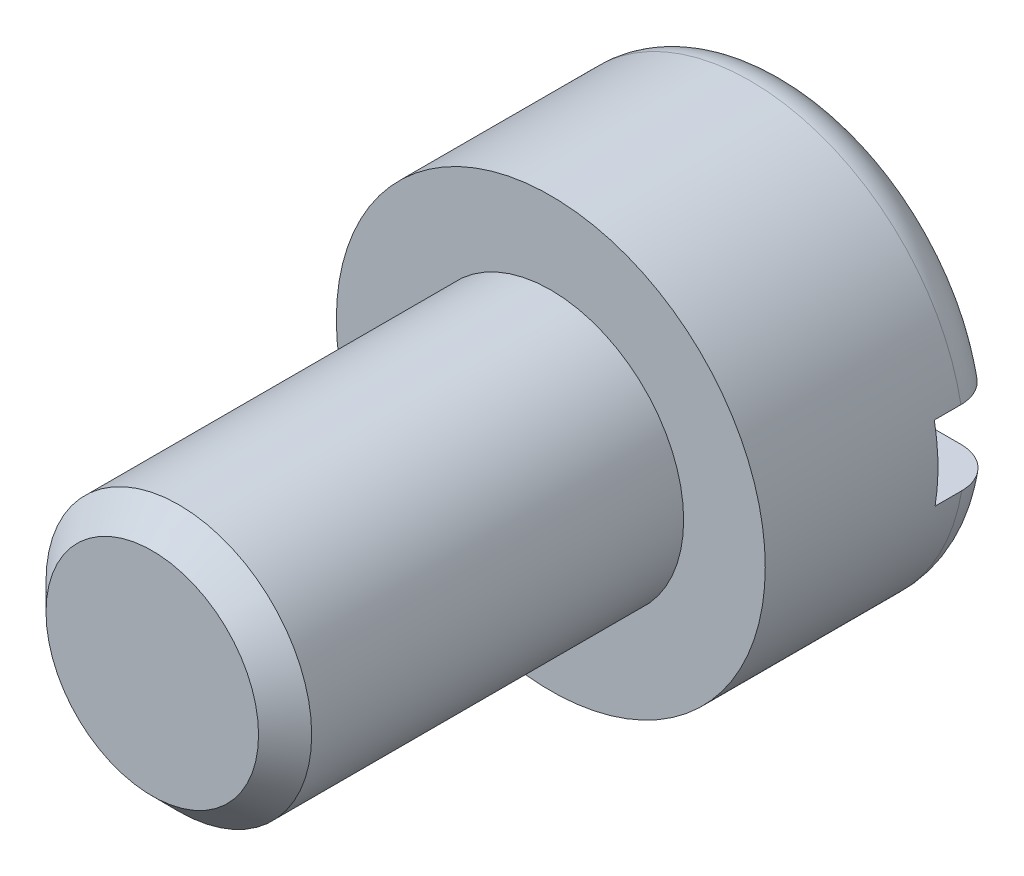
ISO-10303-21;
HEADER;
FILE_DESCRIPTION(('STEP AP214'),'2;1');
FILE_NAME('part.step','',(''),(''),'','','');
FILE_SCHEMA(('AUTOMOTIVE_DESIGN { 1 0 10303 214 1 1 1 1 }'));
ENDSEC;
DATA;
#1=APPLICATION_CONTEXT('core data for automotive mechanical design processes');
#2=APPLICATION_PROTOCOL_DEFINITION('international standard','automotive_design',2000,#1);
#3=PRODUCT_CONTEXT('',#1,'mechanical');
#4=PRODUCT('Part','Part','',(#3));
#5=PRODUCT_RELATED_PRODUCT_CATEGORY('part','',(#4));
#6=PRODUCT_DEFINITION_FORMATION('','',#4);
#7=PRODUCT_DEFINITION_CONTEXT('part definition',#1,'design');
#8=PRODUCT_DEFINITION('design','',#6,#7);
#9=PRODUCT_DEFINITION_SHAPE('','',#8);
#10=(LENGTH_UNIT() NAMED_UNIT(*) SI_UNIT(.MILLI.,.METRE.));
#11=(NAMED_UNIT(*) PLANE_ANGLE_UNIT() SI_UNIT($,.RADIAN.));
#12=(NAMED_UNIT(*) SI_UNIT($,.STERADIAN.) SOLID_ANGLE_UNIT());
#13=UNCERTAINTY_MEASURE_WITH_UNIT(LENGTH_MEASURE(1.E-05),#10,'distance_accuracy_value','');
#14=(GEOMETRIC_REPRESENTATION_CONTEXT(3) GLOBAL_UNCERTAINTY_ASSIGNED_CONTEXT((#13)) GLOBAL_UNIT_ASSIGNED_CONTEXT((#10,
#11,#12)) REPRESENTATION_CONTEXT('',''));
#15=CARTESIAN_POINT('',(0.,0.,0.));
#16=DIRECTION('',(0.,0.,1.));
#17=DIRECTION('',(1.,0.,0.));
#18=AXIS2_PLACEMENT_3D('',#15,#16,#17);
#19=CARTESIAN_POINT('',(0.,0.,-1.8));
#20=DIRECTION('',(0.,0.,-1.));
#21=DIRECTION('',(-1.,0.,0.));
#22=AXIS2_PLACEMENT_3D('',#19,#20,#21);
#23=PLANE('',#22);
#24=DIRECTION('',(1.,0.,0.));
#25=VECTOR('',#24,1.);
#26=CARTESIAN_POINT('',(2.10059804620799,0.295447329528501,-1.8));
#27=LINE('',#26,#25);
#28=CARTESIAN_POINT('',(-1.28077355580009,0.295447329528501,-1.8));
#29=VERTEX_POINT('',#28);
#30=CARTESIAN_POINT('',(1.28077355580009,0.295447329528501,-1.8));
#31=VERTEX_POINT('',#30);
#32=EDGE_CURVE('E93',#29,#31,#27,.T.);
#33=ORIENTED_EDGE('',*,*,#32,.F.);
#34=CARTESIAN_POINT('',(0.,0.,-1.8));
#35=DIRECTION('',(0.,0.,-1.));
#36=DIRECTION('',(-1.,0.,0.));
#37=AXIS2_PLACEMENT_3D('',#34,#35,#36);
#38=CIRCLE('',#37,1.31440862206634);
#39=EDGE_CURVE('E96',#29,#31,#38,.T.);
#40=ORIENTED_EDGE('',*,*,#39,.T.);
#41=EDGE_LOOP('',(#33,#40));
#42=FACE_BOUND('',#41,.T.);
#43=ADVANCED_FACE('F26',(#42),#23,.T.);
#44=CARTESIAN_POINT('',(0.,0.,-1.5));
#45=DIRECTION('',(0.,0.,-1.));
#46=DIRECTION('',(-1.,0.,0.));
#47=AXIS2_PLACEMENT_3D('',#44,#45,#46);
#48=TOROIDAL_SURFACE('',#47,1.31440862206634,0.3);
#49=CARTESIAN_POINT('',(-1.53651760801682,0.295447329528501,-1.66544460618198));
#50=CARTESIAN_POINT('',(-1.52700600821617,0.295447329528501,-1.6795717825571));
#51=CARTESIAN_POINT('',(-1.51627677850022,0.295447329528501,-1.69289589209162));
#52=CARTESIAN_POINT('',(-1.49271348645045,0.295447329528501,-1.71755329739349));
#53=CARTESIAN_POINT('',(-1.47987648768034,0.295447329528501,-1.72888376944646));
#54=CARTESIAN_POINT('',(-1.45250623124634,0.295447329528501,-1.74922518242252));
#55=CARTESIAN_POINT('',(-1.43797521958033,0.295447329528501,-1.75823914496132));
#56=CARTESIAN_POINT('',(-1.40762887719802,0.295447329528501,-1.77373787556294));
#57=CARTESIAN_POINT('',(-1.39181386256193,0.295447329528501,-1.78022326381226));
#58=CARTESIAN_POINT('',(-1.35909219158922,0.295447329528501,-1.79059717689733));
#59=CARTESIAN_POINT('',(-1.3421726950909,0.295447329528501,-1.79444518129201));
#60=CARTESIAN_POINT('',(-1.30793062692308,0.295447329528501,-1.79930680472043));
#61=CARTESIAN_POINT('',(-1.2906079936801,0.295447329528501,-1.80031998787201));
#62=CARTESIAN_POINT('',(-1.25568631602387,0.295447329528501,-1.7994960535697));
#63=CARTESIAN_POINT('',(-1.23808860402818,0.295447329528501,-1.79760200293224));
#64=CARTESIAN_POINT('',(-1.20345024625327,0.295447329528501,-1.79092116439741));
#65=CARTESIAN_POINT('',(-1.18640965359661,0.295447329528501,-1.786134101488));
#66=CARTESIAN_POINT('',(-1.15317476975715,0.295447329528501,-1.77372718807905));
#67=CARTESIAN_POINT('',(-1.13699201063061,0.295447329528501,-1.76607639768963));
#68=CARTESIAN_POINT('',(-1.1061519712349,0.295447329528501,-1.74814694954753));
#69=CARTESIAN_POINT('',(-1.09149470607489,0.295447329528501,-1.73786826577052));
#70=CARTESIAN_POINT('',(-1.06426403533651,0.295447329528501,-1.71503807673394));
#71=CARTESIAN_POINT('',(-1.05167529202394,0.295447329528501,-1.70250489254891));
#72=CARTESIAN_POINT('',(-1.02886060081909,0.295447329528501,-1.67544437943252));
#73=CARTESIAN_POINT('',(-1.01863424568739,0.295447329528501,-1.66091739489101));
#74=CARTESIAN_POINT('',(-1.00118743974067,0.295447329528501,-1.63075152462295));
#75=CARTESIAN_POINT('',(-0.993884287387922,0.295447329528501,-1.61516051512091));
#76=CARTESIAN_POINT('',(-0.982122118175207,0.295447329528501,-1.58294051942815));
#77=CARTESIAN_POINT('',(-0.97766229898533,0.295447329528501,-1.56631182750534));
#78=CARTESIAN_POINT('',(-0.971881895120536,0.295447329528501,-1.5331917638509));
#79=CARTESIAN_POINT('',(-0.970444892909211,0.295447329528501,-1.51672065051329));
#80=CARTESIAN_POINT('',(-0.97041670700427,0.295447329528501,-1.48377718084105));
#81=CARTESIAN_POINT('',(-0.971825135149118,0.295447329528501,-1.46730482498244));
#82=CARTESIAN_POINT('',(-0.977377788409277,0.295447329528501,-1.43515533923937));
#83=CARTESIAN_POINT('',(-0.981469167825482,0.295447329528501,-1.4194690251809));
#84=CARTESIAN_POINT('',(-0.992186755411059,0.295447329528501,-1.38898914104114));
#85=CARTESIAN_POINT('',(-0.998813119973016,0.295447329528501,-1.37419562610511));
#86=CARTESIAN_POINT('',(-1.01450184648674,0.295447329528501,-1.34565540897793));
#87=CARTESIAN_POINT('',(-1.02360141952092,0.295447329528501,-1.3319291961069));
#88=CARTESIAN_POINT('',(-1.04389749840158,0.295447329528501,-1.30612738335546));
#89=CARTESIAN_POINT('',(-1.05509436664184,0.295447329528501,-1.29405206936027));
#90=CARTESIAN_POINT('',(-1.079714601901,0.295447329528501,-1.27141448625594));
#91=CARTESIAN_POINT('',(-1.09320565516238,0.295447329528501,-1.26092582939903));
#92=CARTESIAN_POINT('',(-1.1217096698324,0.295447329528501,-1.24227438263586));
#93=CARTESIAN_POINT('',(-1.13672290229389,0.295447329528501,-1.23411200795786));
#94=CARTESIAN_POINT('',(-1.16838793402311,0.295447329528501,-1.22007518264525));
#95=CARTESIAN_POINT('',(-1.18507772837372,0.295447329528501,-1.2142863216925));
#96=CARTESIAN_POINT('',(-1.219185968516,0.295447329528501,-1.20555067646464));
#97=CARTESIAN_POINT('',(-1.23660448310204,0.295447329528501,-1.20260416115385));
#98=CARTESIAN_POINT('',(-1.27192246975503,0.295447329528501,-1.19962181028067));
#99=CARTESIAN_POINT('',(-1.28982525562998,0.295447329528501,-1.19962493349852));
#100=CARTESIAN_POINT('',(-1.32537330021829,0.295447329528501,-1.20265931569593));
#101=CARTESIAN_POINT('',(-1.34301856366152,0.295447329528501,-1.20569051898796));
#102=CARTESIAN_POINT('',(-1.37740715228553,0.295447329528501,-1.21468720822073));
#103=CARTESIAN_POINT('',(-1.39415615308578,0.295447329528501,-1.22063096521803));
#104=CARTESIAN_POINT('',(-1.4263895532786,0.295447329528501,-1.23529944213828));
#105=CARTESIAN_POINT('',(-1.44187406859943,0.295447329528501,-1.24402390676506));
#106=CARTESIAN_POINT('',(-1.47082300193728,0.295447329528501,-1.26383251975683));
#107=CARTESIAN_POINT('',(-1.4843200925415,0.295447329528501,-1.27486890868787));
#108=CARTESIAN_POINT('',(-1.50922033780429,0.295447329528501,-1.29909463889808));
#109=CARTESIAN_POINT('',(-1.52062373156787,0.295447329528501,-1.31228373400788));
#110=CARTESIAN_POINT('',(-1.54076391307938,0.295447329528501,-1.34014474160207));
#111=CARTESIAN_POINT('',(-1.54955109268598,0.295447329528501,-1.35478023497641));
#112=CARTESIAN_POINT('',(-1.56449665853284,0.295447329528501,-1.38533636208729));
#113=CARTESIAN_POINT('',(-1.57065540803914,0.295447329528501,-1.40125681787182));
#114=CARTESIAN_POINT('',(-1.58007285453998,0.295447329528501,-1.43365387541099));
#115=CARTESIAN_POINT('',(-1.5833767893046,0.295447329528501,-1.45011733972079));
#116=CARTESIAN_POINT('',(-1.58714965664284,0.295447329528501,-1.48337049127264));
#117=CARTESIAN_POINT('',(-1.58761801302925,0.295447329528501,-1.50016024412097));
#118=CARTESIAN_POINT('',(-1.58571176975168,0.295447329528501,-1.5334486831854));
#119=CARTESIAN_POINT('',(-1.58335848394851,0.295447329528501,-1.5499486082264));
#120=CARTESIAN_POINT('',(-1.57591759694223,0.295447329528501,-1.582304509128));
#121=CARTESIAN_POINT('',(-1.57083346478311,0.295447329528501,-1.59816127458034));
#122=CARTESIAN_POINT('',(-1.56068504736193,0.295447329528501,-1.62257067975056));
#123=CARTESIAN_POINT('',(-1.55644926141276,0.295447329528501,-1.63147704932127));
#124=CARTESIAN_POINT('',(-1.54711740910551,0.295447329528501,-1.64882677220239));
#125=CARTESIAN_POINT('',(-1.54202135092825,0.295447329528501,-1.65727012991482));
#126=CARTESIAN_POINT('',(-1.53651760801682,0.295447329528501,-1.66544460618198));
#127=B_SPLINE_CURVE_WITH_KNOTS('',3,(#49,#50,#51,#52,#53,#54,#55,#56,#57,#58,#59,#60,#61,#62,
#63,#64,#65,#66,#67,#68,#69,#70,#71,#72,#73,#74,#75,#76,#77,#78,#79,#80,#81,#82,#83,#84,#85,#86,
#87,#88,#89,#90,#91,#92,#93,#94,#95,#96,#97,#98,#99,#100,#101,#102,#103,#104,#105,#106,#107,
#108,#109,#110,#111,#112,#113,#114,#115,#116,#117,#118,#119,#120,#121,#122,#123,#124,#125,#126),
.UNSPECIFIED.,.T.,.F.,(4,2,2,2,2,2,2,2,2,2,2,2,2,2,2,2,2,2,2,2,2,2,2,2,2,2,2,2,2,2,2,2,2,2,2,2,
2,2,4),(0.,0.0510555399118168,0.102182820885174,0.153243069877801,0.204290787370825,
0.256106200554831,0.307929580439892,0.360780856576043,0.413637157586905,0.467081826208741,
0.520527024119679,0.573556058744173,0.626575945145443,0.677966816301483,0.729343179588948,
0.778701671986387,0.828053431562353,0.876461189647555,0.924871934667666,0.974055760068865,
1.02324809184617,1.07428294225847,1.12532689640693,1.17807693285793,1.23083196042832,
1.28428378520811,1.33773462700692,1.39079263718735,1.44384577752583,1.49589532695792,
1.54793892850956,1.59890334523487,1.64986071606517,1.69999496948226,1.75013940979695,
1.79990744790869,1.84961241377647,1.8791552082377,1.90869772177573),.UNSPECIFIED.);
#128=CARTESIAN_POINT('',(-1.58714399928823,0.295447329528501,-1.5));
#129=VERTEX_POINT('',#128);
#130=EDGE_CURVE('E129',#129,#29,#127,.T.);
#131=ORIENTED_EDGE('',*,*,#130,.F.);
#132=CARTESIAN_POINT('',(0.,0.,-1.5));
#133=DIRECTION('',(0.,0.,-1.));
#134=DIRECTION('',(-1.,0.,0.));
#135=AXIS2_PLACEMENT_3D('',#132,#133,#134);
#136=CIRCLE('',#135,1.61440862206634);
#137=CARTESIAN_POINT('',(1.58714399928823,0.295447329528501,-1.5));
#138=VERTEX_POINT('',#137);
#139=EDGE_CURVE('E100',#138,#129,#136,.F.);
#140=ORIENTED_EDGE('',*,*,#139,.F.);
#141=CARTESIAN_POINT('',(0.993380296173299,0.295447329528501,-1.61270659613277));
#142=CARTESIAN_POINT('',(1.00000873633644,0.295447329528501,-1.62837682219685));
#143=CARTESIAN_POINT('',(1.00800747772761,0.295447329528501,-1.6434838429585));
#144=CARTESIAN_POINT('',(1.02645873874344,0.295447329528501,-1.67213704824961));
#145=CARTESIAN_POINT('',(1.03691532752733,0.295447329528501,-1.68568058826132));
#146=CARTESIAN_POINT('',(1.05990935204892,0.295447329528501,-1.71081375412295));
#147=CARTESIAN_POINT('',(1.07244233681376,0.295447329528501,-1.72240745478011));
#148=CARTESIAN_POINT('',(1.09922534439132,0.295447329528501,-1.7433907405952));
#149=CARTESIAN_POINT('',(1.11347491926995,0.295447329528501,-1.75278089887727));
#150=CARTESIAN_POINT('',(1.14371148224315,0.295447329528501,-1.76936765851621));
#151=CARTESIAN_POINT('',(1.15973546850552,0.295447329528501,-1.7764968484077));
#152=CARTESIAN_POINT('',(1.1927393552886,0.295447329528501,-1.78802290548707));
#153=CARTESIAN_POINT('',(1.20971941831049,0.295447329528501,-1.79241930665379));
#154=CARTESIAN_POINT('',(1.24450325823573,0.295447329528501,-1.79841707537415));
#155=CARTESIAN_POINT('',(1.26231658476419,0.295447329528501,-1.79996326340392));
#156=CARTESIAN_POINT('',(1.29795031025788,0.295447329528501,-1.80003543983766));
#157=CARTESIAN_POINT('',(1.31577070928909,0.295447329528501,-1.7985613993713));
#158=CARTESIAN_POINT('',(1.35085693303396,0.295447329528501,-1.79261965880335));
#159=CARTESIAN_POINT('',(1.36812413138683,0.295447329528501,-1.78816009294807));
#160=CARTESIAN_POINT('',(1.40164317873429,0.295447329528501,-1.77635542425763));
#161=CARTESIAN_POINT('',(1.41789511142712,0.295447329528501,-1.76901055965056));
#162=CARTESIAN_POINT('',(1.44862388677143,0.295447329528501,-1.75177111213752));
#163=CARTESIAN_POINT('',(1.4631261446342,0.295447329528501,-1.74192184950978));
#164=CARTESIAN_POINT('',(1.49022502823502,0.295447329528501,-1.71987959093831));
#165=CARTESIAN_POINT('',(1.50282187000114,0.295447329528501,-1.70768686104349));
#166=CARTESIAN_POINT('',(1.5254708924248,0.295447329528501,-1.6815807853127));
#167=CARTESIAN_POINT('',(1.53557106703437,0.295447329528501,-1.66770907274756));
#168=CARTESIAN_POINT('',(1.55324958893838,0.295447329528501,-1.63844214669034));
#169=CARTESIAN_POINT('',(1.56082820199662,0.295447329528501,-1.62304709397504));
#170=CARTESIAN_POINT('',(1.57311326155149,0.295447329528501,-1.59146483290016));
#171=CARTESIAN_POINT('',(1.57786813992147,0.295447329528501,-1.57529645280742));
#172=CARTESIAN_POINT('',(1.58456448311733,0.295447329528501,-1.54238738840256));
#173=CARTESIAN_POINT('',(1.58650614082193,0.295447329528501,-1.52564674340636));
#174=CARTESIAN_POINT('',(1.58751026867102,0.295447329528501,-1.49225186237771));
#175=CARTESIAN_POINT('',(1.58660205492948,0.295447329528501,-1.47559850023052));
#176=CARTESIAN_POINT('',(1.5819986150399,0.295447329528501,-1.44268202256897));
#177=CARTESIAN_POINT('',(1.57830345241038,0.295447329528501,-1.42641889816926));
#178=CARTESIAN_POINT('',(1.5682455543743,0.295447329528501,-1.39476180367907));
#179=CARTESIAN_POINT('',(1.56188601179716,0.295447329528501,-1.37936681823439));
#180=CARTESIAN_POINT('',(1.54669201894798,0.295447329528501,-1.34985167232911));
#181=CARTESIAN_POINT('',(1.53785750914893,0.295447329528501,-1.33573154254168));
#182=CARTESIAN_POINT('',(1.5178968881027,0.295447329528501,-1.3090426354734));
#183=CARTESIAN_POINT('',(1.50675326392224,0.295447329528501,-1.2964869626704));
#184=CARTESIAN_POINT('',(1.48254533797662,0.295447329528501,-1.27338978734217));
#185=CARTESIAN_POINT('',(1.46948090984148,0.295447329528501,-1.26284841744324));
#186=CARTESIAN_POINT('',(1.4415876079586,0.295447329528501,-1.2438988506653));
#187=CARTESIAN_POINT('',(1.42673436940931,0.295447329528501,-1.23552653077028));
#188=CARTESIAN_POINT('',(1.39585412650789,0.295447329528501,-1.22133795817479));
#189=CARTESIAN_POINT('',(1.37982700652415,0.295447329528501,-1.21552195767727));
#190=CARTESIAN_POINT('',(1.34670756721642,0.295447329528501,-1.2064856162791));
#191=CARTESIAN_POINT('',(1.32960024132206,0.295447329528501,-1.20332027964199));
#192=CARTESIAN_POINT('',(1.29509801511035,0.295447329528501,-1.19984740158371));
#193=CARTESIAN_POINT('',(1.27770308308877,0.295447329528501,-1.19954017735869));
#194=CARTESIAN_POINT('',(1.24276316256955,0.295447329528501,-1.20179543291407));
#195=CARTESIAN_POINT('',(1.22522173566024,0.295447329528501,-1.20441329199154));
#196=CARTESIAN_POINT('',(1.19081669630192,0.295447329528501,-1.21252762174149));
#197=CARTESIAN_POINT('',(1.17395314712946,0.295447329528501,-1.21802436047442));
#198=CARTESIAN_POINT('',(1.141223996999,0.295447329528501,-1.23181535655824));
#199=CARTESIAN_POINT('',(1.12536918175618,0.295447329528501,-1.24013525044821));
#200=CARTESIAN_POINT('',(1.09529909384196,0.295447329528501,-1.25934536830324));
#201=CARTESIAN_POINT('',(1.08108381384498,0.295447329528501,-1.27023558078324));
#202=CARTESIAN_POINT('',(1.05487952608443,0.295447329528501,-1.29417473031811));
#203=CARTESIAN_POINT('',(1.04286843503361,0.295447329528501,-1.30719945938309));
#204=CARTESIAN_POINT('',(1.02129298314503,0.295447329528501,-1.33513914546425));
#205=CARTESIAN_POINT('',(1.01172803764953,0.295447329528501,-1.350053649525));
#206=CARTESIAN_POINT('',(0.99566805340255,0.295447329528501,-1.38082652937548));
#207=CARTESIAN_POINT('',(0.989081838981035,0.295447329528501,-1.39663728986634));
#208=CARTESIAN_POINT('',(0.978776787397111,0.295447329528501,-1.42917189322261));
#209=CARTESIAN_POINT('',(0.975057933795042,0.295447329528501,-1.44589573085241));
#210=CARTESIAN_POINT('',(0.970723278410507,0.295447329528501,-1.47909298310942));
#211=CARTESIAN_POINT('',(0.969995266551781,0.295447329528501,-1.49555188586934));
#212=CARTESIAN_POINT('',(0.971363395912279,0.295447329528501,-1.52833629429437));
#213=CARTESIAN_POINT('',(0.973455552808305,0.295447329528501,-1.54466195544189));
#214=CARTESIAN_POINT('',(0.978831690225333,0.295447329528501,-1.56958546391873));
#215=CARTESIAN_POINT('',(0.981174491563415,0.295447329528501,-1.57839703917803));
#216=CARTESIAN_POINT('',(0.986673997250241,0.295447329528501,-1.59576177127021));
#217=CARTESIAN_POINT('',(0.989830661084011,0.295447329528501,-1.60431494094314));
#218=CARTESIAN_POINT('',(0.993380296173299,0.295447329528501,-1.61270659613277));
#219=B_SPLINE_CURVE_WITH_KNOTS('',3,(#141,#142,#143,#144,#145,#146,#147,#148,#149,#150,#151,
#152,#153,#154,#155,#156,#157,#158,#159,#160,#161,#162,#163,#164,#165,#166,#167,#168,#169,#170,
#171,#172,#173,#174,#175,#176,#177,#178,#179,#180,#181,#182,#183,#184,#185,#186,#187,#188,#189,
#190,#191,#192,#193,#194,#195,#196,#197,#198,#199,#200,#201,#202,#203,#204,#205,#206,#207,#208,
#209,#210,#211,#212,#213,#214,#215,#216,#217,#218),.UNSPECIFIED.,.T.,.F.,(4,2,2,2,2,2,2,2,2,2,2,
2,2,2,2,2,2,2,2,2,2,2,2,2,2,2,2,2,2,2,2,2,2,2,2,2,2,2,4),(0.,0.0510085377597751,
0.102102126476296,0.153087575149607,0.204059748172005,0.256433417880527,0.30881601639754,
0.362202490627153,0.415589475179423,0.468831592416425,0.522069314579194,0.574404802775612,
0.626734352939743,0.677962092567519,0.729184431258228,0.779500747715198,0.82981361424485,
0.879610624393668,0.92940649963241,0.979142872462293,1.02888044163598,1.07901002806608,
1.12914291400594,1.18005856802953,1.23097924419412,1.28293209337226,1.33489070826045,
1.38784995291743,1.44081412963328,1.49427274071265,1.54773111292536,1.60062054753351,
1.6534973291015,1.7046229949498,1.75574836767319,1.80493706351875,1.85405633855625,
1.88137358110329,1.90868946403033),.UNSPECIFIED.);
#220=EDGE_CURVE('E126',#31,#138,#219,.T.);
#221=ORIENTED_EDGE('',*,*,#220,.F.);
#222=ORIENTED_EDGE('',*,*,#39,.F.);
#223=EDGE_LOOP('',(#131,#140,#221,#222));
#224=FACE_BOUND('',#223,.T.);
#225=ADVANCED_FACE('F174',(#224),#48,.T.);
#226=CARTESIAN_POINT('',(0.,0.,3.));
#227=DIRECTION('',(0.,0.,-1.));
#228=DIRECTION('',(-1.,0.,0.));
#229=AXIS2_PLACEMENT_3D('',#226,#227,#228);
#230=CYLINDRICAL_SURFACE('',#229,1.);
#231=CARTESIAN_POINT('',(0.,0.,2.8));
#232=DIRECTION('',(0.,0.,1.));
#233=DIRECTION('',(1.,0.,0.));
#234=AXIS2_PLACEMENT_3D('',#231,#232,#233);
#235=CIRCLE('',#234,1.);
#236=CARTESIAN_POINT('',(1.,0.,2.8));
#237=VERTEX_POINT('',#236);
#238=EDGE_CURVE('E97',#237,#237,#235,.F.);
#239=ORIENTED_EDGE('',*,*,#238,.T.);
#240=EDGE_LOOP('',(#239));
#241=FACE_BOUND('',#240,.T.);
#242=CARTESIAN_POINT('',(0.,0.,0.));
#243=DIRECTION('',(0.,0.,-1.));
#244=DIRECTION('',(-1.,0.,0.));
#245=AXIS2_PLACEMENT_3D('',#242,#243,#244);
#246=CIRCLE('',#245,1.);
#247=CARTESIAN_POINT('',(-1.,0.,0.));
#248=VERTEX_POINT('',#247);
#249=EDGE_CURVE('E154',#248,#248,#246,.T.);
#250=ORIENTED_EDGE('',*,*,#249,.F.);
#251=EDGE_LOOP('',(#250));
#252=FACE_BOUND('',#251,.T.);
#253=ADVANCED_FACE('F28',(#241,#252),#230,.T.);
#254=CARTESIAN_POINT('',(0.,0.,3.));
#255=DIRECTION('',(0.,0.,1.));
#256=DIRECTION('',(1.,0.,0.));
#257=AXIS2_PLACEMENT_3D('',#254,#255,#256);
#258=PLANE('',#257);
#259=CARTESIAN_POINT('',(0.,0.,3.));
#260=DIRECTION('',(0.,0.,1.));
#261=DIRECTION('',(1.,0.,0.));
#262=AXIS2_PLACEMENT_3D('',#259,#260,#261);
#263=CIRCLE('',#262,0.8);
#264=CARTESIAN_POINT('',(0.8,0.,3.));
#265=VERTEX_POINT('',#264);
#266=EDGE_CURVE('E102',#265,#265,#263,.T.);
#267=ORIENTED_EDGE('',*,*,#266,.T.);
#268=EDGE_LOOP('',(#267));
#269=FACE_BOUND('',#268,.T.);
#270=ADVANCED_FACE('F159',(#269),#258,.T.);
#271=CARTESIAN_POINT('',(0.,0.,3.));
#272=DIRECTION('',(0.,0.,-1.));
#273=DIRECTION('',(-1.,0.,0.));
#274=AXIS2_PLACEMENT_3D('',#271,#272,#273);
#275=CONICAL_SURFACE('',#274,0.8,0.785398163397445);
#276=ORIENTED_EDGE('',*,*,#238,.F.);
#277=EDGE_LOOP('',(#276));
#278=FACE_BOUND('',#277,.T.);
#279=ORIENTED_EDGE('',*,*,#266,.F.);
#280=EDGE_LOOP('',(#279));
#281=FACE_BOUND('',#280,.T.);
#282=ADVANCED_FACE('F161',(#278,#281),#275,.T.);
#283=CARTESIAN_POINT('',(0.,0.,0.));
#284=DIRECTION('',(0.,0.,-1.));
#285=DIRECTION('',(-1.,0.,0.));
#286=AXIS2_PLACEMENT_3D('',#283,#284,#285);
#287=PLANE('',#286);
#288=CARTESIAN_POINT('',(0.,0.,0.));
#289=DIRECTION('',(0.,0.,-1.));
#290=DIRECTION('',(-1.,0.,0.));
#291=AXIS2_PLACEMENT_3D('',#288,#289,#290);
#292=CIRCLE('',#291,1.61440862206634);
#293=CARTESIAN_POINT('',(-1.61440862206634,0.,0.));
#294=VERTEX_POINT('',#293);
#295=EDGE_CURVE('E151',#294,#294,#292,.T.);
#296=ORIENTED_EDGE('',*,*,#295,.F.);
#297=EDGE_LOOP('',(#296));
#298=FACE_BOUND('',#297,.T.);
#299=ORIENTED_EDGE('',*,*,#249,.T.);
#300=EDGE_LOOP('',(#299));
#301=FACE_BOUND('',#300,.T.);
#302=ADVANCED_FACE('F163',(#298,#301),#287,.F.);
#303=CARTESIAN_POINT('',(0.,0.,-1.8));
#304=DIRECTION('',(0.,0.,1.));
#305=DIRECTION('',(1.,0.,0.));
#306=AXIS2_PLACEMENT_3D('',#303,#304,#305);
#307=CYLINDRICAL_SURFACE('',#306,1.61440862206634);
#308=CARTESIAN_POINT('',(0.,0.,-1.3));
#309=DIRECTION('',(0.,0.,-1.));
#310=DIRECTION('',(-1.,0.,0.));
#311=AXIS2_PLACEMENT_3D('',#308,#309,#310);
#312=CIRCLE('',#311,1.61440862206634);
#313=CARTESIAN_POINT('',(1.58714399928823,0.295447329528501,-1.3));
#314=VERTEX_POINT('',#313);
#315=CARTESIAN_POINT('',(1.59284538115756,-0.262980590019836,-1.3));
#316=VERTEX_POINT('',#315);
#317=EDGE_CURVE('E11',#314,#316,#312,.T.);
#318=ORIENTED_EDGE('',*,*,#317,.F.);
#319=DIRECTION('',(0.,0.,1.));
#320=VECTOR('',#319,1.);
#321=CARTESIAN_POINT('',(1.58714399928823,0.295447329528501,-1.8));
#322=LINE('',#321,#320);
#323=EDGE_CURVE('E143',#314,#138,#322,.F.);
#324=ORIENTED_EDGE('',*,*,#323,.T.);
#325=ORIENTED_EDGE('',*,*,#139,.T.);
#326=DIRECTION('',(0.,0.,1.));
#327=VECTOR('',#326,1.);
#328=CARTESIAN_POINT('',(-1.58714399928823,0.295447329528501,-1.8));
#329=LINE('',#328,#327);
#330=CARTESIAN_POINT('',(-1.58714399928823,0.295447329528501,-1.3));
#331=VERTEX_POINT('',#330);
#332=EDGE_CURVE('E49',#129,#331,#329,.T.);
#333=ORIENTED_EDGE('',*,*,#332,.T.);
#334=CARTESIAN_POINT('',(-1.59284538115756,-0.262980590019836,-1.3));
#335=VERTEX_POINT('',#334);
#336=EDGE_CURVE('E30',#335,#331,#312,.T.);
#337=ORIENTED_EDGE('',*,*,#336,.F.);
#338=DIRECTION('',(0.,0.,1.));
#339=VECTOR('',#338,1.);
#340=CARTESIAN_POINT('',(-1.59284538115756,-0.262980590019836,-1.8));
#341=LINE('',#340,#339);
#342=CARTESIAN_POINT('',(-1.59284538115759,-0.262980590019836,-1.49999999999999));
#343=VERTEX_POINT('',#342);
#344=EDGE_CURVE('E136',#335,#343,#341,.F.);
#345=ORIENTED_EDGE('',*,*,#344,.T.);
#346=CARTESIAN_POINT('',(1.59284538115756,-0.262980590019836,-1.5));
#347=VERTEX_POINT('',#346);
#348=EDGE_CURVE('E87',#343,#347,#136,.F.);
#349=ORIENTED_EDGE('',*,*,#348,.T.);
#350=DIRECTION('',(0.,0.,1.));
#351=VECTOR('',#350,1.);
#352=CARTESIAN_POINT('',(1.59284538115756,-0.262980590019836,-1.8));
#353=LINE('',#352,#351);
#354=EDGE_CURVE('E41',#347,#316,#353,.T.);
#355=ORIENTED_EDGE('',*,*,#354,.T.);
#356=EDGE_LOOP('',(#318,#324,#325,#333,#337,#345,#349,#355));
#357=FACE_BOUND('',#356,.T.);
#358=ORIENTED_EDGE('',*,*,#295,.T.);
#359=EDGE_LOOP('',(#358));
#360=FACE_BOUND('',#359,.T.);
#361=ADVANCED_FACE('F141',(#357,#360),#307,.T.);
#362=DIRECTION('',(-1.,0.,0.));
#363=VECTOR('',#362,1.);
#364=CARTESIAN_POINT('',(2.10059804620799,-0.262980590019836,-1.8));
#365=LINE('',#364,#363);
#366=CARTESIAN_POINT('',(1.28783199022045,-0.262980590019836,-1.8));
#367=VERTEX_POINT('',#366);
#368=CARTESIAN_POINT('',(-1.28783199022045,-0.262980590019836,-1.8));
#369=VERTEX_POINT('',#368);
#370=EDGE_CURVE('E80',#367,#369,#365,.T.);
#371=ORIENTED_EDGE('',*,*,#370,.F.);
#372=EDGE_CURVE('E92',#367,#369,#38,.T.);
#373=ORIENTED_EDGE('',*,*,#372,.T.);
#374=EDGE_LOOP('',(#371,#373));
#375=FACE_BOUND('',#374,.T.);
#376=ADVANCED_FACE('F91',(#375),#23,.T.);
#377=CARTESIAN_POINT('',(-1.54037139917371,-0.262980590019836,-1.66843930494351));
#378=CARTESIAN_POINT('',(-1.54984004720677,-0.262980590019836,-1.65468194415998));
#379=CARTESIAN_POINT('',(-1.55816117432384,-0.262980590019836,-1.64012108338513));
#380=CARTESIAN_POINT('',(-1.57225074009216,-0.262980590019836,-1.60979891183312));
#381=CARTESIAN_POINT('',(-1.57801644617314,-0.262980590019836,-1.59403633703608));
#382=CARTESIAN_POINT('',(-1.58681207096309,-0.262980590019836,-1.56176655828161));
#383=CARTESIAN_POINT('',(-1.58984245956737,-0.262980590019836,-1.54525948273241));
#384=CARTESIAN_POINT('',(-1.59307520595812,-0.262980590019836,-1.51197464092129));
#385=CARTESIAN_POINT('',(-1.59327821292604,-0.262980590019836,-1.49519693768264));
#386=CARTESIAN_POINT('',(-1.59085687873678,-0.262980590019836,-1.46191358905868));
#387=CARTESIAN_POINT('',(-1.58824367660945,-0.262980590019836,-1.44540713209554));
#388=CARTESIAN_POINT('',(-1.580286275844,-0.262980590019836,-1.41306612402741));
#389=CARTESIAN_POINT('',(-1.57494200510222,-0.262980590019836,-1.397231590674));
#390=CARTESIAN_POINT('',(-1.56167417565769,-0.262980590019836,-1.36665946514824));
#391=CARTESIAN_POINT('',(-1.5537473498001,-0.262980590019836,-1.3519232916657));
#392=CARTESIAN_POINT('',(-1.53555143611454,-0.262980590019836,-1.32397671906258));
#393=CARTESIAN_POINT('',(-1.52528228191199,-0.262980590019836,-1.3107663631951));
#394=CARTESIAN_POINT('',(-1.50260714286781,-0.262980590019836,-1.28612530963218));
#395=CARTESIAN_POINT('',(-1.49018419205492,-0.262980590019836,-1.27471022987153));
#396=CARTESIAN_POINT('',(-1.46362081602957,-0.262980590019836,-1.25409401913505));
#397=CARTESIAN_POINT('',(-1.44948028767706,-0.262980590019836,-1.24489302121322));
#398=CARTESIAN_POINT('',(-1.4196760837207,-0.262980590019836,-1.2288275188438));
#399=CARTESIAN_POINT('',(-1.40399405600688,-0.262980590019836,-1.22199706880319));
#400=CARTESIAN_POINT('',(-1.37171804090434,-0.262980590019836,-1.21101836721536));
#401=CARTESIAN_POINT('',(-1.35512397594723,-0.262980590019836,-1.20687034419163));
#402=CARTESIAN_POINT('',(-1.32120527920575,-0.262980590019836,-1.20130405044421));
#403=CARTESIAN_POINT('',(-1.30387313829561,-0.262980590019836,-1.19993152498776));
#404=CARTESIAN_POINT('',(-1.26922052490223,-0.262980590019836,-1.20007375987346));
#405=CARTESIAN_POINT('',(-1.25190005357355,-0.262980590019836,-1.20158877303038));
#406=CARTESIAN_POINT('',(-1.2175142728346,-0.262980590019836,-1.20749533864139));
#407=CARTESIAN_POINT('',(-1.20045559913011,-0.262980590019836,-1.21192558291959));
#408=CARTESIAN_POINT('',(-1.16731853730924,-0.262980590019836,-1.22357728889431));
#409=CARTESIAN_POINT('',(-1.15124020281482,-0.262980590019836,-1.2307989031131));
#410=CARTESIAN_POINT('',(-1.12047816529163,-0.262980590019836,-1.24786923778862));
#411=CARTESIAN_POINT('',(-1.10579888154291,-0.262980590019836,-1.25772593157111));
#412=CARTESIAN_POINT('',(-1.07833270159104,-0.262980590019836,-1.27979682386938));
#413=CARTESIAN_POINT('',(-1.06554571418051,-0.262980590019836,-1.29201090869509));
#414=CARTESIAN_POINT('',(-1.04243987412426,-0.262980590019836,-1.31827651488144));
#415=CARTESIAN_POINT('',(-1.0320883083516,-0.262980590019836,-1.33229922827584));
#416=CARTESIAN_POINT('',(-1.01397008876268,-0.262980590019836,-1.36192618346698));
#417=CARTESIAN_POINT('',(-1.00620294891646,-0.262980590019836,-1.37753012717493));
#418=CARTESIAN_POINT('',(-0.993720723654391,-0.262980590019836,-1.40938655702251));
#419=CARTESIAN_POINT('',(-0.988922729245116,-0.262980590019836,-1.42560655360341));
#420=CARTESIAN_POINT('',(-0.982202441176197,-0.262980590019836,-1.45863109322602));
#421=CARTESIAN_POINT('',(-0.980279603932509,-0.262980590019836,-1.47543552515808));
#422=CARTESIAN_POINT('',(-0.979393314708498,-0.262980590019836,-1.5086706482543));
#423=CARTESIAN_POINT('',(-0.980352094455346,-0.262980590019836,-1.52509931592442));
#424=CARTESIAN_POINT('',(-0.985025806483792,-0.262980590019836,-1.5575587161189));
#425=CARTESIAN_POINT('',(-0.988740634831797,-0.262980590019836,-1.57358946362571));
#426=CARTESIAN_POINT('',(-0.998777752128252,-0.262980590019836,-1.60474942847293));
#427=CARTESIAN_POINT('',(-1.00509101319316,-0.262980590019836,-1.61988156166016));
#428=CARTESIAN_POINT('',(-1.02011499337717,-0.262980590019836,-1.64890359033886));
#429=CARTESIAN_POINT('',(-1.0288259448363,-0.262980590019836,-1.66279336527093));
#430=CARTESIAN_POINT('',(-1.04859296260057,-0.262980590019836,-1.68927050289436));
#431=CARTESIAN_POINT('',(-1.05969648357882,-0.262980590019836,-1.70182241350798));
#432=CARTESIAN_POINT('',(-1.08379693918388,-0.262980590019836,-1.72495286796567));
#433=CARTESIAN_POINT('',(-1.0967941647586,-0.262980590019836,-1.73553110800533));
#434=CARTESIAN_POINT('',(-1.12473956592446,-0.262980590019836,-1.75474846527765));
#435=CARTESIAN_POINT('',(-1.13973506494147,-0.262980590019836,-1.76331879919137));
#436=CARTESIAN_POINT('',(-1.17093089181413,-0.262980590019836,-1.77787875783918));
#437=CARTESIAN_POINT('',(-1.187131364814,-0.262980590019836,-1.78386807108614));
#438=CARTESIAN_POINT('',(-1.22063125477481,-0.262980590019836,-1.79320471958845));
#439=CARTESIAN_POINT('',(-1.23794626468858,-0.262980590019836,-1.79649621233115));
#440=CARTESIAN_POINT('',(-1.27288297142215,-0.262980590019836,-1.80013507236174));
#441=CARTESIAN_POINT('',(-1.29050466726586,-0.262980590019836,-1.80048244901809));
#442=CARTESIAN_POINT('',(-1.32560363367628,-0.262980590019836,-1.79820675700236));
#443=CARTESIAN_POINT('',(-1.34308039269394,-0.262980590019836,-1.79557575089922));
#444=CARTESIAN_POINT('',(-1.37733894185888,-0.262980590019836,-1.78738370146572));
#445=CARTESIAN_POINT('',(-1.39412058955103,-0.262980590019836,-1.78182206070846));
#446=CARTESIAN_POINT('',(-1.42631765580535,-0.262980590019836,-1.76798090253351));
#447=CARTESIAN_POINT('',(-1.44174532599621,-0.262980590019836,-1.75972985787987));
#448=CARTESIAN_POINT('',(-1.4709504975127,-0.262980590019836,-1.74071855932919));
#449=CARTESIAN_POINT('',(-1.48473011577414,-0.262980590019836,-1.72996157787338));
#450=CARTESIAN_POINT('',(-1.50550162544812,-0.262980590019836,-1.71064261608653));
#451=CARTESIAN_POINT('',(-1.51311844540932,-0.262980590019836,-1.70274128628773));
#452=CARTESIAN_POINT('',(-1.52744547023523,-0.262980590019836,-1.6861551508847));
#453=CARTESIAN_POINT('',(-1.5341556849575,-0.262980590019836,-1.67747035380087));
#454=CARTESIAN_POINT('',(-1.54037139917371,-0.262980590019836,-1.66843930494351));
#455=B_SPLINE_CURVE_WITH_KNOTS('',3,(#377,#378,#379,#380,#381,#382,#383,#384,#385,#386,#387,
#388,#389,#390,#391,#392,#393,#394,#395,#396,#397,#398,#399,#400,#401,#402,#403,#404,#405,#406,
#407,#408,#409,#410,#411,#412,#413,#414,#415,#416,#417,#418,#419,#420,#421,#422,#423,#424,#425,
#426,#427,#428,#429,#430,#431,#432,#433,#434,#435,#436,#437,#438,#439,#440,#441,#442,#443,#444,
#445,#446,#447,#448,#449,#450,#451,#452,#453,#454),.UNSPECIFIED.,.T.,.F.,(4,2,2,2,2,2,2,2,2,2,2,
2,2,2,2,2,2,2,2,2,2,2,2,2,2,2,2,2,2,2,2,2,2,2,2,2,2,2,4),(0.,0.0500631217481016,
0.100179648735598,0.150287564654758,0.200383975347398,0.25028296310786,0.300183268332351,
0.350146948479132,0.400112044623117,0.450490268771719,0.500871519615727,0.551949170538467,
0.603031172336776,0.654948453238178,0.706870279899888,0.759495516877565,0.812123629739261,
0.864912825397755,0.917699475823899,0.969730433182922,1.02175160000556,1.07224550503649,
1.1227298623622,1.17186410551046,1.2209964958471,1.2699596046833,1.31892745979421,
1.36897456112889,1.41902935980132,1.47060694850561,1.52219076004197,1.57481711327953,
1.62744329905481,1.68021006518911,1.73298759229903,1.78522358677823,1.83739174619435,
1.87025614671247,1.90312018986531),.UNSPECIFIED.);
#456=EDGE_CURVE('E86',#369,#343,#455,.T.);
#457=ORIENTED_EDGE('',*,*,#456,.F.);
#458=ORIENTED_EDGE('',*,*,#372,.F.);
#459=CARTESIAN_POINT('',(1.00157745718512,-0.262980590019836,-1.61056693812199));
#460=CARTESIAN_POINT('',(0.995374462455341,-0.262980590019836,-1.59543229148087));
#461=CARTESIAN_POINT('',(0.990429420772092,-0.262980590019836,-1.57977101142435));
#462=CARTESIAN_POINT('',(0.983233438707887,-0.262980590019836,-1.54783006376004));
#463=CARTESIAN_POINT('',(0.980984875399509,-0.262980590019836,-1.53154986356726));
#464=CARTESIAN_POINT('',(0.979267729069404,-0.262980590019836,-1.49884287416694));
#465=CARTESIAN_POINT('',(0.979798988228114,-0.262980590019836,-1.48241609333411));
#466=CARTESIAN_POINT('',(0.983622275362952,-0.262980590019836,-1.44989100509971));
#467=CARTESIAN_POINT('',(0.986913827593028,-0.262980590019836,-1.43379264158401));
#468=CARTESIAN_POINT('',(0.996127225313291,-0.262980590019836,-1.40241747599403));
#469=CARTESIAN_POINT('',(1.00204175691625,-0.262980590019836,-1.38713852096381));
#470=CARTESIAN_POINT('',(1.01630175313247,-0.262980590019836,-1.35776140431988));
#471=CARTESIAN_POINT('',(1.02464749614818,-0.262980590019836,-1.34366337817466));
#472=CARTESIAN_POINT('',(1.0437038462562,-0.262980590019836,-1.31673190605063));
#473=CARTESIAN_POINT('',(1.05445941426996,-0.262980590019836,-1.30393029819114));
#474=CARTESIAN_POINT('',(1.07790898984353,-0.262980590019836,-1.28024708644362));
#475=CARTESIAN_POINT('',(1.09060328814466,-0.262980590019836,-1.26936577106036));
#476=CARTESIAN_POINT('',(1.11798760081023,-0.262980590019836,-1.24948498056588));
#477=CARTESIAN_POINT('',(1.1327267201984,-0.262980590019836,-1.24055311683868));
#478=CARTESIAN_POINT('',(1.16347124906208,-0.262980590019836,-1.22522954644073));
#479=CARTESIAN_POINT('',(1.17947681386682,-0.262980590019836,-1.2188381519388));
#480=CARTESIAN_POINT('',(1.21267084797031,-0.262980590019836,-1.20865077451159));
#481=CARTESIAN_POINT('',(1.22987731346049,-0.262980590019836,-1.20491332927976));
#482=CARTESIAN_POINT('',(1.26467353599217,-0.262980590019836,-1.20036636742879));
#483=CARTESIAN_POINT('',(1.28226330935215,-0.262980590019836,-1.19955697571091));
#484=CARTESIAN_POINT('',(1.31740236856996,-0.262980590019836,-1.20090421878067));
#485=CARTESIAN_POINT('',(1.33495119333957,-0.262980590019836,-1.2030730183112));
#486=CARTESIAN_POINT('',(1.36942734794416,-0.262980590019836,-1.21035611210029));
#487=CARTESIAN_POINT('',(1.38635470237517,-0.262980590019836,-1.21547028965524));
#488=CARTESIAN_POINT('',(1.4189232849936,-0.262980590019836,-1.22845289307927));
#489=CARTESIAN_POINT('',(1.43457564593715,-0.262980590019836,-1.23629337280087));
#490=CARTESIAN_POINT('',(1.46431202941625,-0.262980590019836,-1.25453235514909));
#491=CARTESIAN_POINT('',(1.47839618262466,-0.262980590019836,-1.26493064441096));
#492=CARTESIAN_POINT('',(1.50435282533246,-0.262980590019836,-1.28781033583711));
#493=CARTESIAN_POINT('',(1.5162573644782,-0.262980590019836,-1.30025537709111));
#494=CARTESIAN_POINT('',(1.53776809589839,-0.262980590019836,-1.32699472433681));
#495=CARTESIAN_POINT('',(1.54737449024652,-0.262980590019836,-1.34128886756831));
#496=CARTESIAN_POINT('',(1.56386204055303,-0.262980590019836,-1.37108132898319));
#497=CARTESIAN_POINT('',(1.57078308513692,-0.262980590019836,-1.3865575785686));
#498=CARTESIAN_POINT('',(1.58189685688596,-0.262980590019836,-1.41846049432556));
#499=CARTESIAN_POINT('',(1.58608976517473,-0.262980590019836,-1.43488709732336));
#500=CARTESIAN_POINT('',(1.5915884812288,-0.262980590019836,-1.46803656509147));
#501=CARTESIAN_POINT('',(1.59292451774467,-0.262980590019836,-1.48475442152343));
#502=CARTESIAN_POINT('',(1.5927589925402,-0.262980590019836,-1.51817579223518));
#503=CARTESIAN_POINT('',(1.59125752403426,-0.262980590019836,-1.53487930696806));
#504=CARTESIAN_POINT('',(1.58547404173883,-0.262980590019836,-1.56773118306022));
#505=CARTESIAN_POINT('',(1.58120270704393,-0.262980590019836,-1.58388142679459));
#506=CARTESIAN_POINT('',(1.57001829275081,-0.262980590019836,-1.61523916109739));
#507=CARTESIAN_POINT('',(1.56310520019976,-0.262980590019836,-1.63044664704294));
#508=CARTESIAN_POINT('',(1.54681449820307,-0.262980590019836,-1.65954737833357));
#509=CARTESIAN_POINT('',(1.5374284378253,-0.262980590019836,-1.67343589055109));
#510=CARTESIAN_POINT('',(1.51647961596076,-0.262980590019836,-1.69945990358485));
#511=CARTESIAN_POINT('',(1.50491676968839,-0.262980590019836,-1.71159533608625));
#512=CARTESIAN_POINT('',(1.47982097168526,-0.262980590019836,-1.733904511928));
#513=CARTESIAN_POINT('',(1.46626921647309,-0.262980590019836,-1.74405709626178));
#514=CARTESIAN_POINT('',(1.43767433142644,-0.262980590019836,-1.7619821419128));
#515=CARTESIAN_POINT('',(1.42263109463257,-0.262980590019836,-1.76975443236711));
#516=CARTESIAN_POINT('',(1.39124041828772,-0.262980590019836,-1.78282433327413));
#517=CARTESIAN_POINT('',(1.37487680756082,-0.262980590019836,-1.78808309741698));
#518=CARTESIAN_POINT('',(1.34150622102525,-0.262980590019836,-1.79582725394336));
#519=CARTESIAN_POINT('',(1.32449918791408,-0.262980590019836,-1.79831239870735));
#520=CARTESIAN_POINT('',(1.2900304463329,-0.262980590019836,-1.80047732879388));
#521=CARTESIAN_POINT('',(1.27256583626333,-0.262980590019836,-1.80011099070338));
#522=CARTESIAN_POINT('',(1.23793950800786,-0.262980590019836,-1.79648647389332));
#523=CARTESIAN_POINT('',(1.22077780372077,-0.262980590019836,-1.79322816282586));
#524=CARTESIAN_POINT('',(1.18704335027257,-0.262980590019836,-1.78386083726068));
#525=CARTESIAN_POINT('',(1.17047931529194,-0.262980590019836,-1.77772040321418));
#526=CARTESIAN_POINT('',(1.13861343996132,-0.262980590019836,-1.76274025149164));
#527=CARTESIAN_POINT('',(1.12331195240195,-0.262980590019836,-1.75389978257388));
#528=CARTESIAN_POINT('',(1.09444483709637,-0.262980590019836,-1.73376613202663));
#529=CARTESIAN_POINT('',(1.08087719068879,-0.262980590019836,-1.72247584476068));
#530=CARTESIAN_POINT('',(1.05588987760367,-0.262980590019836,-1.69774422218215));
#531=CARTESIAN_POINT('',(1.04446742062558,-0.262980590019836,-1.68430572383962));
#532=CARTESIAN_POINT('',(1.02774721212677,-0.262980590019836,-1.66074336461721));
#533=CARTESIAN_POINT('',(1.02171365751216,-0.262980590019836,-1.65113310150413));
#534=CARTESIAN_POINT('',(1.01077790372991,-0.262980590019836,-1.63128848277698));
#535=CARTESIAN_POINT('',(1.00587567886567,-0.262980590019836,-1.62105414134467));
#536=CARTESIAN_POINT('',(1.00157745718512,-0.262980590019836,-1.61056693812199));
#537=B_SPLINE_CURVE_WITH_KNOTS('',3,(#459,#460,#461,#462,#463,#464,#465,#466,#467,#468,#469,
#470,#471,#472,#473,#474,#475,#476,#477,#478,#479,#480,#481,#482,#483,#484,#485,#486,#487,#488,
#489,#490,#491,#492,#493,#494,#495,#496,#497,#498,#499,#500,#501,#502,#503,#504,#505,#506,#507,
#508,#509,#510,#511,#512,#513,#514,#515,#516,#517,#518,#519,#520,#521,#522,#523,#524,#525,#526,
#527,#528,#529,#530,#531,#532,#533,#534,#535,#536),.UNSPECIFIED.,.T.,.F.,(4,2,2,2,2,2,2,2,2,2,2,
2,2,2,2,2,2,2,2,2,2,2,2,2,2,2,2,2,2,2,2,2,2,2,2,2,2,2,4),(0.,0.0490289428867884,
0.0981010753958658,0.147170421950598,0.196231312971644,0.245156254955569,0.294086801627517,
0.344020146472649,0.393960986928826,0.445426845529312,0.496899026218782,0.549473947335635,
0.602051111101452,0.654843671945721,0.707634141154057,0.759898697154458,0.812158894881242,
0.863574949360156,0.914986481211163,0.965602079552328,1.01621431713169,1.06628831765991,
1.11636067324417,1.16624111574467,1.21612180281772,1.26617521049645,1.31623056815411,
1.3667939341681,1.41736092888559,1.4686860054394,1.52001566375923,1.57217729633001,
1.62434131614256,1.67708770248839,1.72984877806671,1.78254785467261,1.83517790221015,
1.86915214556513,1.90312561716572),.UNSPECIFIED.);
#538=EDGE_CURVE('E77',#347,#367,#537,.T.);
#539=ORIENTED_EDGE('',*,*,#538,.F.);
#540=ORIENTED_EDGE('',*,*,#348,.F.);
#541=EDGE_LOOP('',(#457,#458,#539,#540));
#542=FACE_BOUND('',#541,.T.);
#543=ADVANCED_FACE('F95',(#542),#48,.T.);
#544=CARTESIAN_POINT('',(2.10059804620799,-0.262980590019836,-1.3));
#545=DIRECTION('',(0.,0.,-1.));
#546=DIRECTION('',(-1.,0.,0.));
#547=AXIS2_PLACEMENT_3D('',#544,#545,#546);
#548=PLANE('',#547);
#549=ORIENTED_EDGE('',*,*,#317,.T.);
#550=DIRECTION('',(-1.,0.,0.));
#551=VECTOR('',#550,1.);
#552=CARTESIAN_POINT('',(2.10059804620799,-0.262980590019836,-1.3));
#553=LINE('',#552,#551);
#554=EDGE_CURVE('E216',#316,#335,#553,.T.);
#555=ORIENTED_EDGE('',*,*,#554,.T.);
#556=ORIENTED_EDGE('',*,*,#336,.T.);
#557=DIRECTION('',(1.,0.,0.));
#558=VECTOR('',#557,1.);
#559=CARTESIAN_POINT('',(2.10059804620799,0.295447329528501,-1.3));
#560=LINE('',#559,#558);
#561=EDGE_CURVE('E146',#331,#314,#560,.T.);
#562=ORIENTED_EDGE('',*,*,#561,.T.);
#563=EDGE_LOOP('',(#549,#555,#556,#562));
#564=FACE_BOUND('',#563,.T.);
#565=ADVANCED_FACE('F124',(#564),#548,.T.);
#566=CARTESIAN_POINT('',(2.10059804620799,0.295447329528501,-1.3));
#567=DIRECTION('',(0.,1.,0.));
#568=DIRECTION('',(0.,0.,1.));
#569=AXIS2_PLACEMENT_3D('',#566,#567,#568);
#570=PLANE('',#569);
#571=ORIENTED_EDGE('',*,*,#130,.T.);
#572=ORIENTED_EDGE('',*,*,#32,.T.);
#573=ORIENTED_EDGE('',*,*,#220,.T.);
#574=ORIENTED_EDGE('',*,*,#323,.F.);
#575=ORIENTED_EDGE('',*,*,#561,.F.);
#576=ORIENTED_EDGE('',*,*,#332,.F.);
#577=EDGE_LOOP('',(#571,#572,#573,#574,#575,#576));
#578=FACE_BOUND('',#577,.T.);
#579=ADVANCED_FACE('F119',(#578),#570,.F.);
#580=CARTESIAN_POINT('',(2.10059804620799,-0.262980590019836,-1.3));
#581=DIRECTION('',(0.,-1.,0.));
#582=DIRECTION('',(0.,0.,-1.));
#583=AXIS2_PLACEMENT_3D('',#580,#581,#582);
#584=PLANE('',#583);
#585=ORIENTED_EDGE('',*,*,#554,.F.);
#586=ORIENTED_EDGE('',*,*,#354,.F.);
#587=ORIENTED_EDGE('',*,*,#538,.T.);
#588=ORIENTED_EDGE('',*,*,#370,.T.);
#589=ORIENTED_EDGE('',*,*,#456,.T.);
#590=ORIENTED_EDGE('',*,*,#344,.F.);
#591=EDGE_LOOP('',(#585,#586,#587,#588,#589,#590));
#592=FACE_BOUND('',#591,.T.);
#593=ADVANCED_FACE('F79',(#592),#584,.F.);
#594=CLOSED_SHELL('',(#43,#225,#253,#270,#282,#302,#361,#376,#543,#565,#579,#593));
#595=MANIFOLD_SOLID_BREP('B2',#594);
#596=ADVANCED_BREP_SHAPE_REPRESENTATION('',(#18,#595),#14);
#597=SHAPE_DEFINITION_REPRESENTATION(#9,#596);
ENDSEC;
END-ISO-10303-21;
